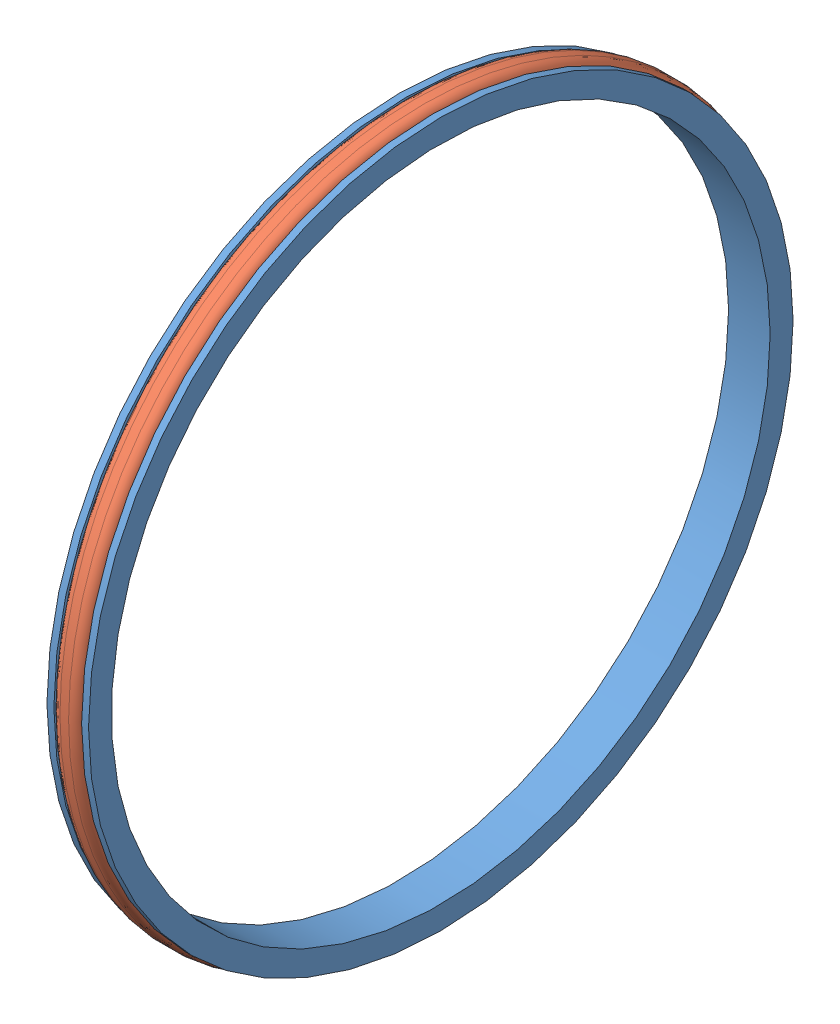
SolidWorks assembly GRA (assemblé).SLDASM, configuration GRA 095-OR98.02x3.53V (file format 3400). Lengths in mm.
Overall size (6 102.6 102.6).
2 component instances, 2 part files, 3 mates.
Components (placement in the parent):
- GRA (profil)-1: GRA (profil).SLDPRT [GRA 095] at (59.4093 76.9864 0) size (6 101.6 101.6)
- ORing (profil)-1: ORing (profil).SLDPRT [OR 98,02 x 3,53] at (-13.4077 76.9864 0) size (4 102.6 102.6)
Mates (geometry in assembly coordinates):
- Coïncidente1: coincident anti-aligned: plane of ?; plane of ?
- Coaxial1: concentric anti-aligned: cylinder of ?; cylinder of ?
- Parallèle1: parallel aligned: plane of ?; plane of ?
